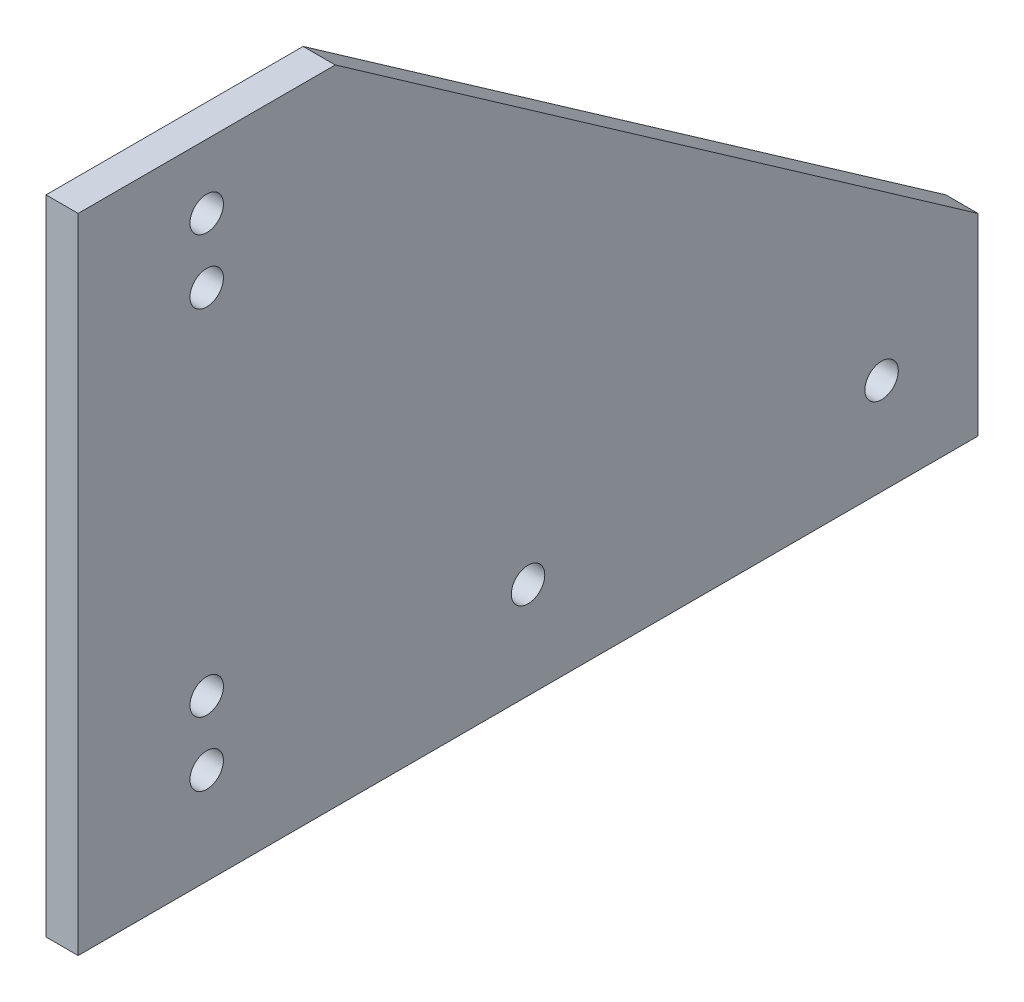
ISO-10303-21;
HEADER;
FILE_DESCRIPTION(('STEP AP214'),'2;1');
FILE_NAME('part.step','',(''),(''),'','','');
FILE_SCHEMA(('AUTOMOTIVE_DESIGN { 1 0 10303 214 1 1 1 1 }'));
ENDSEC;
DATA;
#1=APPLICATION_CONTEXT('core data for automotive mechanical design processes');
#2=APPLICATION_PROTOCOL_DEFINITION('international standard','automotive_design',2000,#1);
#3=PRODUCT_CONTEXT('',#1,'mechanical');
#4=PRODUCT('Part','Part','',(#3));
#5=PRODUCT_RELATED_PRODUCT_CATEGORY('part','',(#4));
#6=PRODUCT_DEFINITION_FORMATION('','',#4);
#7=PRODUCT_DEFINITION_CONTEXT('part definition',#1,'design');
#8=PRODUCT_DEFINITION('design','',#6,#7);
#9=PRODUCT_DEFINITION_SHAPE('','',#8);
#10=(LENGTH_UNIT() NAMED_UNIT(*) SI_UNIT(.MILLI.,.METRE.));
#11=(NAMED_UNIT(*) PLANE_ANGLE_UNIT() SI_UNIT($,.RADIAN.));
#12=(NAMED_UNIT(*) SI_UNIT($,.STERADIAN.) SOLID_ANGLE_UNIT());
#13=UNCERTAINTY_MEASURE_WITH_UNIT(LENGTH_MEASURE(1.E-05),#10,'distance_accuracy_value','');
#14=(GEOMETRIC_REPRESENTATION_CONTEXT(3) GLOBAL_UNCERTAINTY_ASSIGNED_CONTEXT((#13)) GLOBAL_UNIT_ASSIGNED_CONTEXT((#10,
#11,#12)) REPRESENTATION_CONTEXT('',''));
#15=CARTESIAN_POINT('',(0.,0.,0.));
#16=DIRECTION('',(0.,0.,1.));
#17=DIRECTION('',(1.,0.,0.));
#18=AXIS2_PLACEMENT_3D('',#15,#16,#17);
#19=CARTESIAN_POINT('',(6.35,0.,0.));
#20=DIRECTION('',(0.,1.,0.));
#21=DIRECTION('',(0.,0.,1.));
#22=AXIS2_PLACEMENT_3D('',#19,#20,#21);
#23=PLANE('',#22);
#24=DIRECTION('',(0.,0.,-1.));
#25=VECTOR('',#24,1.);
#26=CARTESIAN_POINT('',(0.,0.,0.));
#27=LINE('',#26,#25);
#28=CARTESIAN_POINT('',(0.,0.,0.));
#29=VERTEX_POINT('',#28);
#30=CARTESIAN_POINT('',(0.,0.,-177.8));
#31=VERTEX_POINT('',#30);
#32=EDGE_CURVE('E107',#29,#31,#27,.T.);
#33=ORIENTED_EDGE('',*,*,#32,.T.);
#34=DIRECTION('',(-1.,0.,0.));
#35=VECTOR('',#34,1.);
#36=CARTESIAN_POINT('',(6.35,0.,-177.8));
#37=LINE('',#36,#35);
#38=CARTESIAN_POINT('',(6.35,0.,-177.8));
#39=VERTEX_POINT('',#38);
#40=EDGE_CURVE('E11',#39,#31,#37,.T.);
#41=ORIENTED_EDGE('',*,*,#40,.F.);
#42=DIRECTION('',(0.,0.,-1.));
#43=VECTOR('',#42,1.);
#44=CARTESIAN_POINT('',(6.35,0.,0.));
#45=LINE('',#44,#43);
#46=CARTESIAN_POINT('',(6.35,0.,0.));
#47=VERTEX_POINT('',#46);
#48=EDGE_CURVE('E116',#47,#39,#45,.T.);
#49=ORIENTED_EDGE('',*,*,#48,.F.);
#50=DIRECTION('',(-1.,0.,0.));
#51=VECTOR('',#50,1.);
#52=CARTESIAN_POINT('',(6.35,0.,0.));
#53=LINE('',#52,#51);
#54=EDGE_CURVE('E103',#47,#29,#53,.T.);
#55=ORIENTED_EDGE('',*,*,#54,.T.);
#56=EDGE_LOOP('',(#33,#41,#49,#55));
#57=FACE_BOUND('',#56,.T.);
#58=ADVANCED_FACE('F33',(#57),#23,.F.);
#59=CARTESIAN_POINT('',(6.35,0.,-177.8));
#60=DIRECTION('',(0.,0.,1.));
#61=DIRECTION('',(1.,0.,0.));
#62=AXIS2_PLACEMENT_3D('',#59,#60,#61);
#63=PLANE('',#62);
#64=DIRECTION('',(0.,1.,0.));
#65=VECTOR('',#64,1.);
#66=CARTESIAN_POINT('',(0.,0.,-177.8));
#67=LINE('',#66,#65);
#68=CARTESIAN_POINT('',(0.,38.1,-177.8));
#69=VERTEX_POINT('',#68);
#70=EDGE_CURVE('E110',#31,#69,#67,.T.);
#71=ORIENTED_EDGE('',*,*,#70,.T.);
#72=DIRECTION('',(-1.,0.,0.));
#73=VECTOR('',#72,1.);
#74=CARTESIAN_POINT('',(6.35,38.1,-177.8));
#75=LINE('',#74,#73);
#76=CARTESIAN_POINT('',(6.35,38.1,-177.8));
#77=VERTEX_POINT('',#76);
#78=EDGE_CURVE('E41',#77,#69,#75,.T.);
#79=ORIENTED_EDGE('',*,*,#78,.F.);
#80=DIRECTION('',(0.,1.,0.));
#81=VECTOR('',#80,1.);
#82=CARTESIAN_POINT('',(6.35,0.,-177.8));
#83=LINE('',#82,#81);
#84=EDGE_CURVE('E83',#39,#77,#83,.T.);
#85=ORIENTED_EDGE('',*,*,#84,.F.);
#86=ORIENTED_EDGE('',*,*,#40,.T.);
#87=EDGE_LOOP('',(#71,#79,#85,#86));
#88=FACE_BOUND('',#87,.T.);
#89=ADVANCED_FACE('F136',(#88),#63,.F.);
#90=CARTESIAN_POINT('',(6.35,38.1,-177.8));
#91=DIRECTION('',(0.,-0.81923192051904,0.573462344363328));
#92=DIRECTION('',(0.,-0.573462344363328,-0.81923192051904));
#93=AXIS2_PLACEMENT_3D('',#90,#91,#92);
#94=PLANE('',#93);
#95=DIRECTION('',(0.,0.573462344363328,0.81923192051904));
#96=VECTOR('',#95,1.);
#97=CARTESIAN_POINT('',(0.,38.1,-177.8));
#98=LINE('',#97,#96);
#99=CARTESIAN_POINT('',(0.,127.,-50.8));
#100=VERTEX_POINT('',#99);
#101=EDGE_CURVE('E98',#69,#100,#98,.T.);
#102=ORIENTED_EDGE('',*,*,#101,.T.);
#103=DIRECTION('',(-1.,0.,0.));
#104=VECTOR('',#103,1.);
#105=CARTESIAN_POINT('',(6.35,127.,-50.8));
#106=LINE('',#105,#104);
#107=CARTESIAN_POINT('',(6.35,127.,-50.8));
#108=VERTEX_POINT('',#107);
#109=EDGE_CURVE('E95',#108,#100,#106,.T.);
#110=ORIENTED_EDGE('',*,*,#109,.F.);
#111=DIRECTION('',(0.,0.573462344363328,0.81923192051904));
#112=VECTOR('',#111,1.);
#113=CARTESIAN_POINT('',(6.35,38.1,-177.8));
#114=LINE('',#113,#112);
#115=EDGE_CURVE('E87',#77,#108,#114,.T.);
#116=ORIENTED_EDGE('',*,*,#115,.F.);
#117=ORIENTED_EDGE('',*,*,#78,.T.);
#118=EDGE_LOOP('',(#102,#110,#116,#117));
#119=FACE_BOUND('',#118,.T.);
#120=ADVANCED_FACE('F96',(#119),#94,.F.);
#121=CARTESIAN_POINT('',(6.35,127.,0.));
#122=DIRECTION('',(0.,-1.,0.));
#123=DIRECTION('',(0.,0.,-1.));
#124=AXIS2_PLACEMENT_3D('',#121,#122,#123);
#125=PLANE('',#124);
#126=DIRECTION('',(0.,0.,1.));
#127=VECTOR('',#126,1.);
#128=CARTESIAN_POINT('',(0.,127.,0.));
#129=LINE('',#128,#127);
#130=CARTESIAN_POINT('',(0.,127.,0.));
#131=VERTEX_POINT('',#130);
#132=EDGE_CURVE('E69',#100,#131,#129,.T.);
#133=ORIENTED_EDGE('',*,*,#132,.T.);
#134=DIRECTION('',(-1.,0.,0.));
#135=VECTOR('',#134,1.);
#136=CARTESIAN_POINT('',(6.35,127.,0.));
#137=LINE('',#136,#135);
#138=CARTESIAN_POINT('',(6.35,127.,0.));
#139=VERTEX_POINT('',#138);
#140=EDGE_CURVE('E99',#139,#131,#137,.T.);
#141=ORIENTED_EDGE('',*,*,#140,.F.);
#142=DIRECTION('',(0.,0.,1.));
#143=VECTOR('',#142,1.);
#144=CARTESIAN_POINT('',(6.35,127.,0.));
#145=LINE('',#144,#143);
#146=EDGE_CURVE('E91',#108,#139,#145,.T.);
#147=ORIENTED_EDGE('',*,*,#146,.F.);
#148=ORIENTED_EDGE('',*,*,#109,.T.);
#149=EDGE_LOOP('',(#133,#141,#147,#148));
#150=FACE_BOUND('',#149,.T.);
#151=ADVANCED_FACE('F101',(#150),#125,.F.);
#152=CARTESIAN_POINT('',(6.35,0.,0.));
#153=DIRECTION('',(0.,0.,-1.));
#154=DIRECTION('',(-1.,0.,0.));
#155=AXIS2_PLACEMENT_3D('',#152,#153,#154);
#156=PLANE('',#155);
#157=DIRECTION('',(0.,-1.,0.));
#158=VECTOR('',#157,1.);
#159=CARTESIAN_POINT('',(0.,0.,0.));
#160=LINE('',#159,#158);
#161=EDGE_CURVE('E75',#131,#29,#160,.T.);
#162=ORIENTED_EDGE('',*,*,#161,.T.);
#163=ORIENTED_EDGE('',*,*,#54,.F.);
#164=DIRECTION('',(0.,-1.,0.));
#165=VECTOR('',#164,1.);
#166=CARTESIAN_POINT('',(6.35,0.,0.));
#167=LINE('',#166,#165);
#168=EDGE_CURVE('E49',#139,#47,#167,.T.);
#169=ORIENTED_EDGE('',*,*,#168,.F.);
#170=ORIENTED_EDGE('',*,*,#140,.T.);
#171=EDGE_LOOP('',(#162,#163,#169,#170));
#172=FACE_BOUND('',#171,.T.);
#173=ADVANCED_FACE('F124',(#172),#156,.F.);
#174=CARTESIAN_POINT('',(6.35,0.,0.));
#175=DIRECTION('',(1.,0.,0.));
#176=DIRECTION('',(0.,0.,-1.));
#177=AXIS2_PLACEMENT_3D('',#174,#175,#176);
#178=PLANE('',#177);
#179=CARTESIAN_POINT('',(6.35,19.05,-88.9));
#180=DIRECTION('',(1.,0.,0.));
#181=DIRECTION('',(0.,0.,-1.));
#182=AXIS2_PLACEMENT_3D('',#179,#180,#181);
#183=CIRCLE('',#182,3.302);
#184=CARTESIAN_POINT('',(6.35,19.05,-92.202));
#185=VERTEX_POINT('',#184);
#186=EDGE_CURVE('E238',#185,#185,#183,.T.);
#187=ORIENTED_EDGE('',*,*,#186,.F.);
#188=EDGE_LOOP('',(#187));
#189=FACE_BOUND('',#188,.T.);
#190=CARTESIAN_POINT('',(6.35,19.05,-158.75));
#191=DIRECTION('',(1.,0.,0.));
#192=DIRECTION('',(0.,0.,-1.));
#193=AXIS2_PLACEMENT_3D('',#190,#191,#192);
#194=CIRCLE('',#193,3.30200000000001);
#195=CARTESIAN_POINT('',(6.35,19.05,-162.052));
#196=VERTEX_POINT('',#195);
#197=EDGE_CURVE('E240',#196,#196,#194,.T.);
#198=ORIENTED_EDGE('',*,*,#197,.F.);
#199=EDGE_LOOP('',(#198));
#200=FACE_BOUND('',#199,.T.);
#201=CARTESIAN_POINT('',(6.35,31.75,-25.4));
#202=DIRECTION('',(1.,0.,0.));
#203=DIRECTION('',(0.,0.,-1.));
#204=AXIS2_PLACEMENT_3D('',#201,#202,#203);
#205=CIRCLE('',#204,3.302);
#206=CARTESIAN_POINT('',(6.35,31.75,-28.702));
#207=VERTEX_POINT('',#206);
#208=EDGE_CURVE('E246',#207,#207,#205,.T.);
#209=ORIENTED_EDGE('',*,*,#208,.F.);
#210=EDGE_LOOP('',(#209));
#211=FACE_BOUND('',#210,.T.);
#212=CARTESIAN_POINT('',(6.35,19.05,-25.4));
#213=DIRECTION('',(1.,0.,0.));
#214=DIRECTION('',(0.,0.,-1.));
#215=AXIS2_PLACEMENT_3D('',#212,#213,#214);
#216=CIRCLE('',#215,3.302);
#217=CARTESIAN_POINT('',(6.35,19.05,-28.702));
#218=VERTEX_POINT('',#217);
#219=EDGE_CURVE('E252',#218,#218,#216,.T.);
#220=ORIENTED_EDGE('',*,*,#219,.F.);
#221=EDGE_LOOP('',(#220));
#222=FACE_BOUND('',#221,.T.);
#223=CARTESIAN_POINT('',(6.35,101.6,-25.4));
#224=DIRECTION('',(1.,0.,0.));
#225=DIRECTION('',(0.,0.,-1.));
#226=AXIS2_PLACEMENT_3D('',#223,#224,#225);
#227=CIRCLE('',#226,3.30199999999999);
#228=CARTESIAN_POINT('',(6.35,101.6,-28.702));
#229=VERTEX_POINT('',#228);
#230=EDGE_CURVE('E258',#229,#229,#227,.T.);
#231=ORIENTED_EDGE('',*,*,#230,.F.);
#232=EDGE_LOOP('',(#231));
#233=FACE_BOUND('',#232,.T.);
#234=CARTESIAN_POINT('',(6.35,114.3,-25.4));
#235=DIRECTION('',(1.,0.,0.));
#236=DIRECTION('',(0.,0.,-1.));
#237=AXIS2_PLACEMENT_3D('',#234,#235,#236);
#238=CIRCLE('',#237,3.30199999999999);
#239=CARTESIAN_POINT('',(6.35,114.3,-28.702));
#240=VERTEX_POINT('',#239);
#241=EDGE_CURVE('E264',#240,#240,#238,.T.);
#242=ORIENTED_EDGE('',*,*,#241,.F.);
#243=EDGE_LOOP('',(#242));
#244=FACE_BOUND('',#243,.T.);
#245=ORIENTED_EDGE('',*,*,#48,.T.);
#246=ORIENTED_EDGE('',*,*,#84,.T.);
#247=ORIENTED_EDGE('',*,*,#115,.T.);
#248=ORIENTED_EDGE('',*,*,#146,.T.);
#249=ORIENTED_EDGE('',*,*,#168,.T.);
#250=EDGE_LOOP('',(#245,#246,#247,#248,#249));
#251=FACE_BOUND('',#250,.T.);
#252=ADVANCED_FACE('F89',(#189,#200,#211,#222,#233,#244,#251),#178,.T.);
#253=CARTESIAN_POINT('',(0.,0.,0.));
#254=DIRECTION('',(1.,0.,0.));
#255=DIRECTION('',(0.,0.,-1.));
#256=AXIS2_PLACEMENT_3D('',#253,#254,#255);
#257=PLANE('',#256);
#258=CARTESIAN_POINT('',(0.,19.05,-88.9));
#259=DIRECTION('',(1.,0.,0.));
#260=DIRECTION('',(0.,0.,-1.));
#261=AXIS2_PLACEMENT_3D('',#258,#259,#260);
#262=CIRCLE('',#261,3.302);
#263=CARTESIAN_POINT('',(0.,19.05,-92.202));
#264=VERTEX_POINT('',#263);
#265=EDGE_CURVE('E235',#264,#264,#262,.T.);
#266=ORIENTED_EDGE('',*,*,#265,.T.);
#267=EDGE_LOOP('',(#266));
#268=FACE_BOUND('',#267,.T.);
#269=CARTESIAN_POINT('',(0.,19.05,-158.75));
#270=DIRECTION('',(1.,0.,0.));
#271=DIRECTION('',(0.,0.,-1.));
#272=AXIS2_PLACEMENT_3D('',#269,#270,#271);
#273=CIRCLE('',#272,3.30200000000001);
#274=CARTESIAN_POINT('',(0.,19.05,-162.052));
#275=VERTEX_POINT('',#274);
#276=EDGE_CURVE('E243',#275,#275,#273,.T.);
#277=ORIENTED_EDGE('',*,*,#276,.T.);
#278=EDGE_LOOP('',(#277));
#279=FACE_BOUND('',#278,.T.);
#280=CARTESIAN_POINT('',(0.,31.75,-25.4));
#281=DIRECTION('',(1.,0.,0.));
#282=DIRECTION('',(0.,0.,-1.));
#283=AXIS2_PLACEMENT_3D('',#280,#281,#282);
#284=CIRCLE('',#283,3.302);
#285=CARTESIAN_POINT('',(0.,31.75,-28.702));
#286=VERTEX_POINT('',#285);
#287=EDGE_CURVE('E249',#286,#286,#284,.T.);
#288=ORIENTED_EDGE('',*,*,#287,.T.);
#289=EDGE_LOOP('',(#288));
#290=FACE_BOUND('',#289,.T.);
#291=CARTESIAN_POINT('',(0.,19.05,-25.4));
#292=DIRECTION('',(1.,0.,0.));
#293=DIRECTION('',(0.,0.,-1.));
#294=AXIS2_PLACEMENT_3D('',#291,#292,#293);
#295=CIRCLE('',#294,3.302);
#296=CARTESIAN_POINT('',(0.,19.05,-28.702));
#297=VERTEX_POINT('',#296);
#298=EDGE_CURVE('E255',#297,#297,#295,.T.);
#299=ORIENTED_EDGE('',*,*,#298,.T.);
#300=EDGE_LOOP('',(#299));
#301=FACE_BOUND('',#300,.T.);
#302=CARTESIAN_POINT('',(0.,101.6,-25.4));
#303=DIRECTION('',(1.,0.,0.));
#304=DIRECTION('',(0.,0.,-1.));
#305=AXIS2_PLACEMENT_3D('',#302,#303,#304);
#306=CIRCLE('',#305,3.30199999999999);
#307=CARTESIAN_POINT('',(0.,101.6,-28.702));
#308=VERTEX_POINT('',#307);
#309=EDGE_CURVE('E261',#308,#308,#306,.T.);
#310=ORIENTED_EDGE('',*,*,#309,.T.);
#311=EDGE_LOOP('',(#310));
#312=FACE_BOUND('',#311,.T.);
#313=CARTESIAN_POINT('',(0.,114.3,-25.4));
#314=DIRECTION('',(1.,0.,0.));
#315=DIRECTION('',(0.,0.,-1.));
#316=AXIS2_PLACEMENT_3D('',#313,#314,#315);
#317=CIRCLE('',#316,3.30199999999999);
#318=CARTESIAN_POINT('',(0.,114.3,-28.702));
#319=VERTEX_POINT('',#318);
#320=EDGE_CURVE('E111',#319,#319,#317,.T.);
#321=ORIENTED_EDGE('',*,*,#320,.T.);
#322=EDGE_LOOP('',(#321));
#323=FACE_BOUND('',#322,.T.);
#324=ORIENTED_EDGE('',*,*,#32,.F.);
#325=ORIENTED_EDGE('',*,*,#161,.F.);
#326=ORIENTED_EDGE('',*,*,#132,.F.);
#327=ORIENTED_EDGE('',*,*,#101,.F.);
#328=ORIENTED_EDGE('',*,*,#70,.F.);
#329=EDGE_LOOP('',(#324,#325,#326,#327,#328));
#330=FACE_BOUND('',#329,.T.);
#331=ADVANCED_FACE('F120',(#268,#279,#290,#301,#312,#323,#330),#257,.F.);
#332=CARTESIAN_POINT('',(0.,114.3,-25.4));
#333=DIRECTION('',(1.,0.,0.));
#334=DIRECTION('',(0.,0.,-1.));
#335=AXIS2_PLACEMENT_3D('',#332,#333,#334);
#336=CYLINDRICAL_SURFACE('',#335,3.30199999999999);
#337=ORIENTED_EDGE('',*,*,#320,.F.);
#338=EDGE_LOOP('',(#337));
#339=FACE_BOUND('',#338,.T.);
#340=ORIENTED_EDGE('',*,*,#241,.T.);
#341=EDGE_LOOP('',(#340));
#342=FACE_BOUND('',#341,.T.);
#343=ADVANCED_FACE('F169',(#339,#342),#336,.F.);
#344=CARTESIAN_POINT('',(0.,101.6,-25.4));
#345=DIRECTION('',(1.,0.,0.));
#346=DIRECTION('',(0.,0.,-1.));
#347=AXIS2_PLACEMENT_3D('',#344,#345,#346);
#348=CYLINDRICAL_SURFACE('',#347,3.30199999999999);
#349=ORIENTED_EDGE('',*,*,#309,.F.);
#350=EDGE_LOOP('',(#349));
#351=FACE_BOUND('',#350,.T.);
#352=ORIENTED_EDGE('',*,*,#230,.T.);
#353=EDGE_LOOP('',(#352));
#354=FACE_BOUND('',#353,.T.);
#355=ADVANCED_FACE('F178',(#351,#354),#348,.F.);
#356=CARTESIAN_POINT('',(0.,19.05,-25.4));
#357=DIRECTION('',(1.,0.,0.));
#358=DIRECTION('',(0.,0.,-1.));
#359=AXIS2_PLACEMENT_3D('',#356,#357,#358);
#360=CYLINDRICAL_SURFACE('',#359,3.302);
#361=ORIENTED_EDGE('',*,*,#298,.F.);
#362=EDGE_LOOP('',(#361));
#363=FACE_BOUND('',#362,.T.);
#364=ORIENTED_EDGE('',*,*,#219,.T.);
#365=EDGE_LOOP('',(#364));
#366=FACE_BOUND('',#365,.T.);
#367=ADVANCED_FACE('F188',(#363,#366),#360,.F.);
#368=CARTESIAN_POINT('',(0.,31.75,-25.4));
#369=DIRECTION('',(1.,0.,0.));
#370=DIRECTION('',(0.,0.,-1.));
#371=AXIS2_PLACEMENT_3D('',#368,#369,#370);
#372=CYLINDRICAL_SURFACE('',#371,3.302);
#373=ORIENTED_EDGE('',*,*,#287,.F.);
#374=EDGE_LOOP('',(#373));
#375=FACE_BOUND('',#374,.T.);
#376=ORIENTED_EDGE('',*,*,#208,.T.);
#377=EDGE_LOOP('',(#376));
#378=FACE_BOUND('',#377,.T.);
#379=ADVANCED_FACE('F198',(#375,#378),#372,.F.);
#380=CARTESIAN_POINT('',(0.,19.05,-158.75));
#381=DIRECTION('',(1.,0.,0.));
#382=DIRECTION('',(0.,0.,-1.));
#383=AXIS2_PLACEMENT_3D('',#380,#381,#382);
#384=CYLINDRICAL_SURFACE('',#383,3.30200000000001);
#385=ORIENTED_EDGE('',*,*,#276,.F.);
#386=EDGE_LOOP('',(#385));
#387=FACE_BOUND('',#386,.T.);
#388=ORIENTED_EDGE('',*,*,#197,.T.);
#389=EDGE_LOOP('',(#388));
#390=FACE_BOUND('',#389,.T.);
#391=ADVANCED_FACE('F208',(#387,#390),#384,.F.);
#392=CARTESIAN_POINT('',(0.,19.05,-88.9));
#393=DIRECTION('',(1.,0.,0.));
#394=DIRECTION('',(0.,0.,-1.));
#395=AXIS2_PLACEMENT_3D('',#392,#393,#394);
#396=CYLINDRICAL_SURFACE('',#395,3.302);
#397=ORIENTED_EDGE('',*,*,#265,.F.);
#398=EDGE_LOOP('',(#397));
#399=FACE_BOUND('',#398,.T.);
#400=ORIENTED_EDGE('',*,*,#186,.T.);
#401=EDGE_LOOP('',(#400));
#402=FACE_BOUND('',#401,.T.);
#403=ADVANCED_FACE('F218',(#399,#402),#396,.F.);
#404=CLOSED_SHELL('',(#58,#89,#120,#151,#173,#252,#331,#343,#355,#367,#379,#391,#403));
#405=MANIFOLD_SOLID_BREP('B2',#404);
#406=ADVANCED_BREP_SHAPE_REPRESENTATION('',(#18,#405),#14);
#407=SHAPE_DEFINITION_REPRESENTATION(#9,#406);
ENDSEC;
END-ISO-10303-21;
